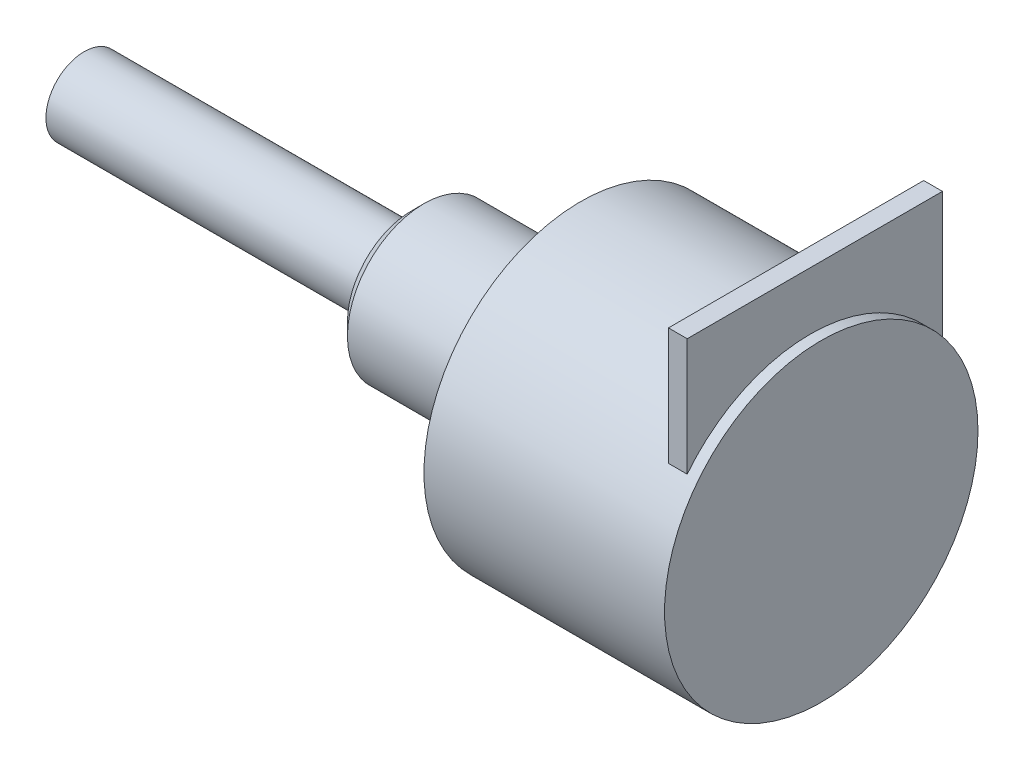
from build123d import *

# Parameters (mm, degrees)
SKETCH3_W      = 0.778233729
SKETCH3_H      = 10.590745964
EXTRUDE1_DEPTH = 8.89
CHAMFER1_SIZE  = 0.508


with BuildPart() as part:
    # Sketch1 → Revolve1 (revolve)
    with BuildSketch(Plane.XY, mode=Mode.PRIVATE) as revolve1_sk:
        Polygon((0, 0), (0, 6.5024), (-9.9822, 6.5024), (-9.9822, 3.175), (-16.9926, 3.175), (-16.9926, 1.5875), (-30.5816, 1.5875), (-30.5816, 0), align=None)
    revolve(revolve1_sk.sketch.rotate(Axis((0, 0, 0), (-1, 0, 0)), 90), axis=Axis((0, 0, 0), (-1, 0, 0)))

    # Sketch3 → Extrude1 (add)
    with BuildSketch(Plane(origin=(0, 0, 0), x_dir=(1, 0, 0), z_dir=(0, 1, 0))):
        with Locations((-0.84272164, 0.18609937)):
            Rectangle(SKETCH3_W, SKETCH3_H)
    extrude(amount=EXTRUDE1_DEPTH)

    # Chamfer1
    chamfer1_edges = [part.edges().sort_by_distance(p)[0] for p in [
        (-16.9926, 0, 3.175),
    ]]
    chamfer(chamfer1_edges, length=CHAMFER1_SIZE)


solid = part.part
